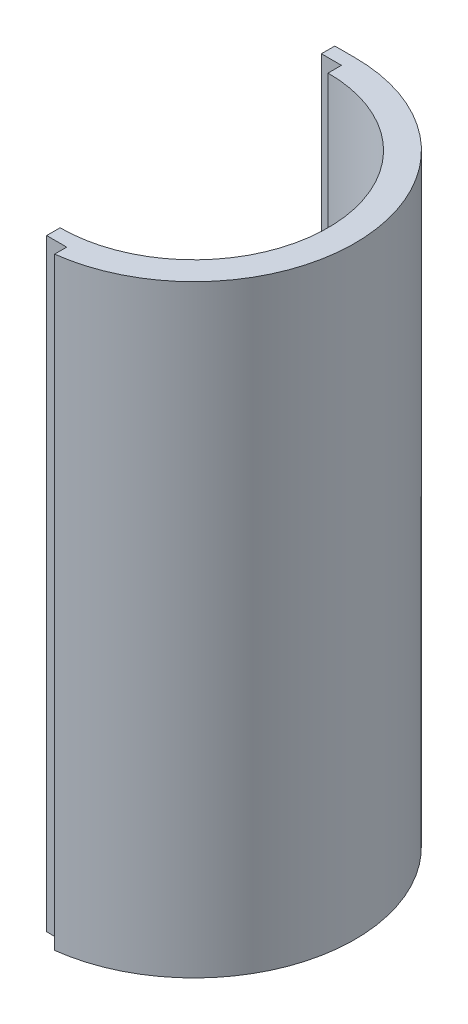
from build123d import *

# Parameters (mm, degrees)
BOSS_EXTRUDE1_DEPTH = 45
SKETCH2_W           = 1.499475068
SKETCH2_H           = 2.751120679
CUT_EXTRUDE1_DEPTH  = 60
SKETCH3_W           = 1.496618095
SKETCH3_H           = 1
BOSS_EXTRUDE2_DEPTH = 45


with BuildPart() as part:
    # Sketch1 → Boss-Extrude1 (new body)
    with BuildSketch(Plane(origin=(0, 0, 0), x_dir=(1, 0, 0), z_dir=(0, 1, 0))):
        with BuildLine():
            Line((0, 10), (0, 12))
            ThreePointArc((0, 12), (12, 0), (0, -12))
            Line((0, -12), (0, -10))
            ThreePointArc((0, -10), (10, 0), (0, 10))
        make_face()
    extrude(amount=BOSS_EXTRUDE1_DEPTH)

    # Sketch2 → Cut-Extrude1 (cut)
    with BuildSketch(Plane(origin=(0, 0, 0), x_dir=(1, 0, 0), z_dir=(0, 1, 0))):
        with Locations((0.749737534, -12.37556034)):
            Rectangle(SKETCH2_W, SKETCH2_H)
    extrude(amount=CUT_EXTRUDE1_DEPTH, mode=Mode.SUBTRACT)

    # Sketch3 → Boss-Extrude2 (add)
    with BuildSketch(Plane(origin=(0, 0, 0), x_dir=(1, 0, 0), z_dir=(0, 1, 0))):
        with Locations((-0.748309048, 11.5)):
            Rectangle(SKETCH3_W, SKETCH3_H)
    extrude(amount=BOSS_EXTRUDE2_DEPTH)


solid = part.part
